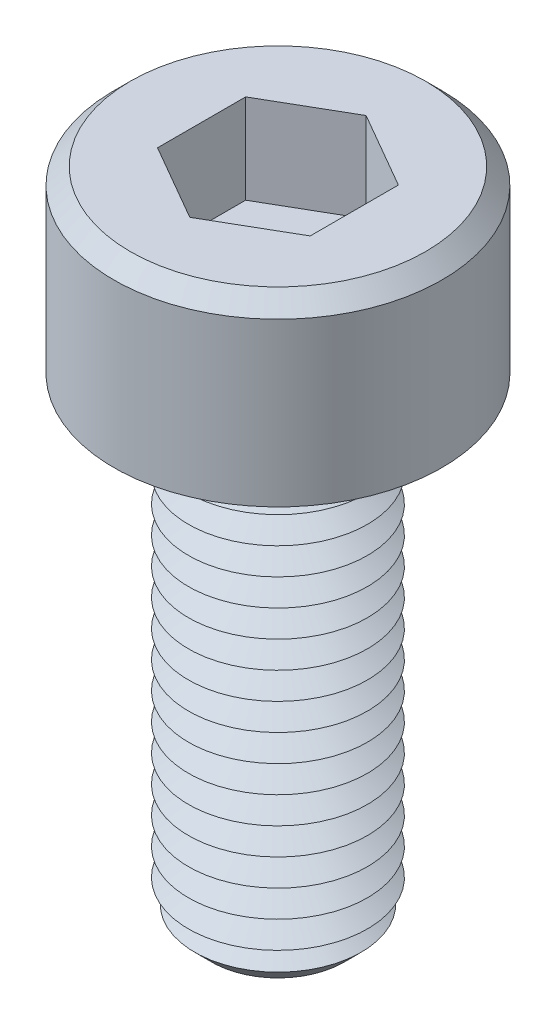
from build123d import *

# Parameters (mm, degrees)
CUT_EXTRUDE1_DEPTH = 1.5


with BuildPart() as part:
    # Sketch1 → Base-Revolve (revolve)
    with BuildSketch(Plane.XY, mode=Mode.PRIVATE) as base_revolve_sk:
        Polygon((0, 0), (2.75, 0), (2.75, 2.725), (2.475, 3), (0, 3), align=None)
    revolve(base_revolve_sk.sketch.rotate(Axis((0, 0, 0), (0, 1, 0)), 90), axis=Axis((0, 0, 0), (0, 1, 0)))

    # Sketch2 → Boss-Revolve1 (revolve)
    with BuildSketch(Plane.XY, mode=Mode.PRIVATE) as boss_revolve1_sk:
        Polygon((0, -8), (1.1087025, -8), (1.395615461, -7.713087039), (1.1087025, -7.548168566), (1.5, -7.322252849), (1.1087025, -7.096337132), (1.5, -6.870421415), (1.1087025, -6.644505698), (1.5, -6.418589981), (1.1087025, -6.192674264), (1.5, -5.966758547), (1.1087025, -5.74084283), (1.5, -5.514927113), (1.1087025, -5.289011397), (1.5, -5.06309568), (1.1087025, -4.837179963), (1.5, -4.611264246), (1.1087025, -4.385348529), (1.5, -4.159432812), (1.1087025, -3.933517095), (1.5, -3.707601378), (1.1087025, -3.481685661), (1.5, -3.255769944), (1.1087025, -3.029854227), (1.5, -2.80393851), (1.1087025, -2.578022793), (1.5, -2.352107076), (1.1087025, -2.126191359), (1.5, -1.900275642), (1.1087025, -1.674359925), (1.5, -1.448444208), (1.1087025, -1.222528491), (1.5, -0.996612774), (1.1087025, -0.770697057), (1.5, -0.54478134), (1.1087025, -0.318865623), (1.5, -0.092949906), (1.5, 0), (0, 0), align=None)
    revolve(boss_revolve1_sk.sketch.rotate(Axis((0, 0, 0), (0, 1, 0)), 90), axis=Axis((0, 0, 0), (0, 1, 0)))

    # Sketch3 → Cut-Extrude1 (cut)
    with BuildSketch(Plane(origin=(0, 3, 0), x_dir=(-1, 0, 0), z_dir=(0, 1, 0))):
        Polygon((1.28, 0.739008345), (0, 1.478016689), (-1.28, 0.739008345), (-1.28, -0.739008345), (0, -1.478016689), (1.28, -0.739008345), align=None)
    extrude(amount=-CUT_EXTRUDE1_DEPTH, mode=Mode.SUBTRACT)


solid = part.part
